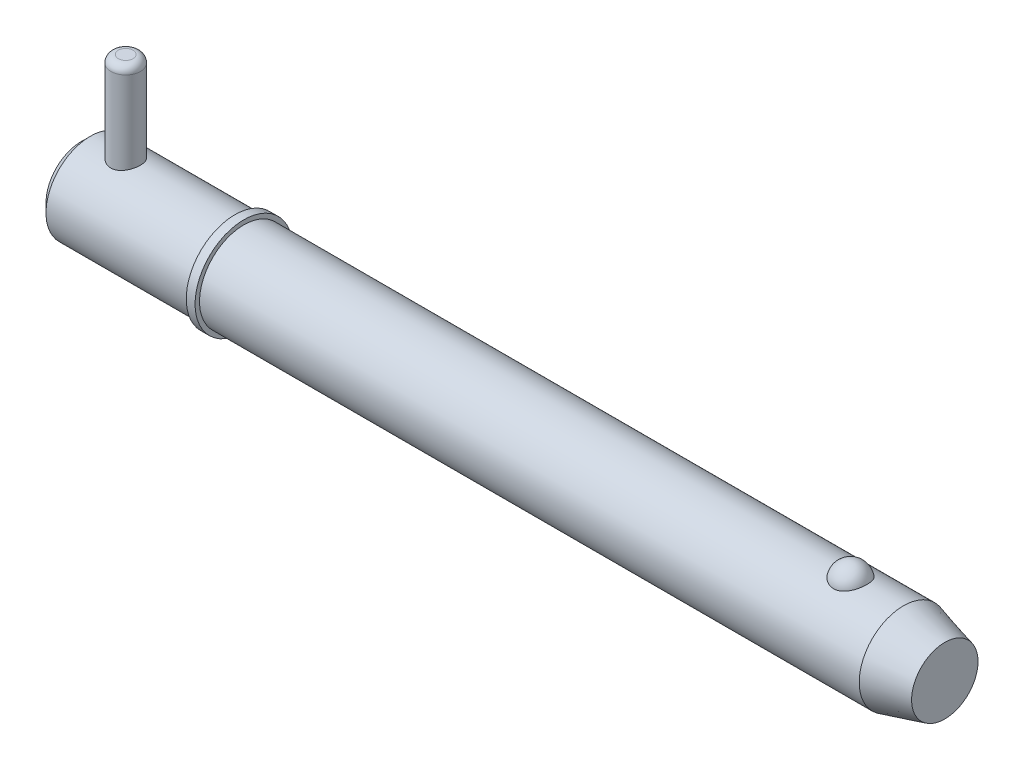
ISO-10303-21;
HEADER;
FILE_DESCRIPTION(('STEP AP214'),'2;1');
FILE_NAME('part.step','',(''),(''),'','','');
FILE_SCHEMA(('AUTOMOTIVE_DESIGN { 1 0 10303 214 1 1 1 1 }'));
ENDSEC;
DATA;
#1=APPLICATION_CONTEXT('core data for automotive mechanical design processes');
#2=APPLICATION_PROTOCOL_DEFINITION('international standard','automotive_design',2000,#1);
#3=PRODUCT_CONTEXT('',#1,'mechanical');
#4=PRODUCT('Part','Part','',(#3));
#5=PRODUCT_RELATED_PRODUCT_CATEGORY('part','',(#4));
#6=PRODUCT_DEFINITION_FORMATION('','',#4);
#7=PRODUCT_DEFINITION_CONTEXT('part definition',#1,'design');
#8=PRODUCT_DEFINITION('design','',#6,#7);
#9=PRODUCT_DEFINITION_SHAPE('','',#8);
#10=(LENGTH_UNIT() NAMED_UNIT(*) SI_UNIT(.MILLI.,.METRE.));
#11=(NAMED_UNIT(*) PLANE_ANGLE_UNIT() SI_UNIT($,.RADIAN.));
#12=(NAMED_UNIT(*) SI_UNIT($,.STERADIAN.) SOLID_ANGLE_UNIT());
#13=UNCERTAINTY_MEASURE_WITH_UNIT(LENGTH_MEASURE(1.E-05),#10,'distance_accuracy_value','');
#14=(GEOMETRIC_REPRESENTATION_CONTEXT(3) GLOBAL_UNCERTAINTY_ASSIGNED_CONTEXT((#13)) GLOBAL_UNIT_ASSIGNED_CONTEXT((#10,
#11,#12)) REPRESENTATION_CONTEXT('',''));
#15=CARTESIAN_POINT('',(0.,0.,0.));
#16=DIRECTION('',(0.,0.,1.));
#17=DIRECTION('',(1.,0.,0.));
#18=AXIS2_PLACEMENT_3D('',#15,#16,#17);
#19=CARTESIAN_POINT('',(9.52500000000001,28.575,0.));
#20=DIRECTION('',(0.,-1.,0.));
#21=DIRECTION('',(0.,0.,-1.));
#22=AXIS2_PLACEMENT_3D('',#19,#20,#21);
#23=CYLINDRICAL_SURFACE('',#22,3.175);
#24=CARTESIAN_POINT('',(9.52500000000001,-7.93750000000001,0.));
#25=DIRECTION('',(0.,1.,0.));
#26=DIRECTION('',(0.,0.,1.));
#27=AXIS2_PLACEMENT_3D('',#24,#25,#26);
#28=CIRCLE('',#27,3.175);
#29=CARTESIAN_POINT('',(9.52500000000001,-7.93750000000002,-3.175));
#30=VERTEX_POINT('',#29);
#31=EDGE_CURVE('P0_E25',#30,#30,#28,.T.);
#32=CARTESIAN_POINT('',(9.52500000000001,26.9875,0.));
#33=DIRECTION('',(0.,1.,0.));
#34=DIRECTION('',(0.,0.,1.));
#35=AXIS2_PLACEMENT_3D('',#32,#33,#34);
#36=CIRCLE('',#35,3.175);
#37=CARTESIAN_POINT('',(9.52500000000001,26.9875,-3.175));
#38=VERTEX_POINT('',#37);
#39=EDGE_CURVE('P0_E29',#38,#38,#36,.F.);
#40=CARTESIAN_POINT('',(9.52500000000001,-7.93750000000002,-3.175));
#41=CARTESIAN_POINT('',(9.52500000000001,-7.57369791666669,-3.175));
#42=CARTESIAN_POINT('',(9.52500000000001,-7.20989583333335,-3.175));
#43=CARTESIAN_POINT('',(9.52500000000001,-6.48229166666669,-3.175));
#44=CARTESIAN_POINT('',(9.52500000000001,-6.11848958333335,-3.175));
#45=CARTESIAN_POINT('',(9.52500000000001,-5.39088541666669,-3.175));
#46=CARTESIAN_POINT('',(9.52500000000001,-5.02708333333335,-3.175));
#47=CARTESIAN_POINT('',(9.52500000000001,-4.29947916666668,-3.175));
#48=CARTESIAN_POINT('',(9.52500000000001,-3.93567708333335,-3.175));
#49=CARTESIAN_POINT('',(9.52500000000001,-3.20807291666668,-3.175));
#50=CARTESIAN_POINT('',(9.52500000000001,-2.84427083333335,-3.175));
#51=CARTESIAN_POINT('',(9.52500000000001,-2.11666666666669,-3.175));
#52=CARTESIAN_POINT('',(9.52500000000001,-1.75286458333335,-3.175));
#53=CARTESIAN_POINT('',(9.52500000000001,-1.02526041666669,-3.175));
#54=CARTESIAN_POINT('',(9.52500000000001,-0.661458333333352,-3.175));
#55=CARTESIAN_POINT('',(9.52500000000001,0.0661458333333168,-3.175));
#56=CARTESIAN_POINT('',(9.52500000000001,0.429947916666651,-3.175));
#57=CARTESIAN_POINT('',(9.52500000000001,1.15755208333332,-3.175));
#58=CARTESIAN_POINT('',(9.52500000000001,1.52135416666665,-3.175));
#59=CARTESIAN_POINT('',(9.52500000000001,2.24895833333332,-3.175));
#60=CARTESIAN_POINT('',(9.52500000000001,2.61276041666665,-3.175));
#61=CARTESIAN_POINT('',(9.52500000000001,3.34036458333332,-3.175));
#62=CARTESIAN_POINT('',(9.52500000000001,3.70416666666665,-3.175));
#63=CARTESIAN_POINT('',(9.52500000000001,4.43177083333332,-3.175));
#64=CARTESIAN_POINT('',(9.52500000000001,4.79557291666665,-3.175));
#65=CARTESIAN_POINT('',(9.52500000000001,5.52317708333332,-3.175));
#66=CARTESIAN_POINT('',(9.52500000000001,5.88697916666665,-3.175));
#67=CARTESIAN_POINT('',(9.52500000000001,6.61458333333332,-3.175));
#68=CARTESIAN_POINT('',(9.52500000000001,6.97838541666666,-3.175));
#69=CARTESIAN_POINT('',(9.52500000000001,7.70598958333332,-3.175));
#70=CARTESIAN_POINT('',(9.52500000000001,8.06979166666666,-3.175));
#71=CARTESIAN_POINT('',(9.52500000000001,8.79739583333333,-3.175));
#72=CARTESIAN_POINT('',(9.52500000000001,9.16119791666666,-3.175));
#73=CARTESIAN_POINT('',(9.52500000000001,9.88880208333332,-3.175));
#74=CARTESIAN_POINT('',(9.52500000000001,10.2526041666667,-3.175));
#75=CARTESIAN_POINT('',(9.52500000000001,10.9802083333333,-3.175));
#76=CARTESIAN_POINT('',(9.52500000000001,11.3440104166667,-3.175));
#77=CARTESIAN_POINT('',(9.52500000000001,12.0716145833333,-3.175));
#78=CARTESIAN_POINT('',(9.52500000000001,12.4354166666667,-3.175));
#79=CARTESIAN_POINT('',(9.52500000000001,13.1630208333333,-3.175));
#80=CARTESIAN_POINT('',(9.52500000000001,13.5268229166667,-3.175));
#81=CARTESIAN_POINT('',(9.52500000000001,14.2544270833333,-3.175));
#82=CARTESIAN_POINT('',(9.52500000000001,14.6182291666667,-3.175));
#83=CARTESIAN_POINT('',(9.52500000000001,15.3458333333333,-3.175));
#84=CARTESIAN_POINT('',(9.52500000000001,15.7096354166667,-3.175));
#85=CARTESIAN_POINT('',(9.52500000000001,16.4372395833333,-3.175));
#86=CARTESIAN_POINT('',(9.52500000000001,16.8010416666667,-3.175));
#87=CARTESIAN_POINT('',(9.52500000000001,17.5286458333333,-3.175));
#88=CARTESIAN_POINT('',(9.52500000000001,17.8924479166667,-3.175));
#89=CARTESIAN_POINT('',(9.52500000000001,18.6200520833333,-3.175));
#90=CARTESIAN_POINT('',(9.52500000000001,18.9838541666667,-3.175));
#91=CARTESIAN_POINT('',(9.52500000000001,19.7114583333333,-3.175));
#92=CARTESIAN_POINT('',(9.52500000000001,20.0752604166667,-3.175));
#93=CARTESIAN_POINT('',(9.52500000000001,20.8028645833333,-3.175));
#94=CARTESIAN_POINT('',(9.52500000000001,21.1666666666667,-3.175));
#95=CARTESIAN_POINT('',(9.52500000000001,21.8942708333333,-3.175));
#96=CARTESIAN_POINT('',(9.52500000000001,22.2580729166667,-3.175));
#97=CARTESIAN_POINT('',(9.52500000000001,22.9856770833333,-3.175));
#98=CARTESIAN_POINT('',(9.52500000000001,23.3494791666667,-3.175));
#99=CARTESIAN_POINT('',(9.52500000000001,24.0770833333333,-3.175));
#100=CARTESIAN_POINT('',(9.52500000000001,24.4408854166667,-3.175));
#101=CARTESIAN_POINT('',(9.52500000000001,25.1684895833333,-3.175));
#102=CARTESIAN_POINT('',(9.52500000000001,25.5322916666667,-3.175));
#103=CARTESIAN_POINT('',(9.52500000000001,26.2598958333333,-3.175));
#104=CARTESIAN_POINT('',(9.52500000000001,26.6236979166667,-3.175));
#105=CARTESIAN_POINT('',(9.52500000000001,26.9875,-3.175));
#106=B_SPLINE_CURVE_WITH_KNOTS('',3,(#40,#41,#42,#43,#44,#45,#46,#47,#48,#49,#50,#51,#52,#53,
#54,#55,#56,#57,#58,#59,#60,#61,#62,#63,#64,#65,#66,#67,#68,#69,#70,#71,#72,#73,#74,#75,#76,#77,
#78,#79,#80,#81,#82,#83,#84,#85,#86,#87,#88,#89,#90,#91,#92,#93,#94,#95,#96,#97,#98,#99,#100,
#101,#102,#103,#104,#105),.UNSPECIFIED.,.F.,.F.,(4,2,2,2,2,2,2,2,2,2,2,2,2,2,2,2,2,2,2,2,2,2,2,
2,2,2,2,2,2,2,2,2,4),(0.,1.09140625,2.1828125,3.27421875,4.365625,5.45703125,6.5484375,
7.63984375,8.73125000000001,9.82265625,10.9140625,12.00546875,13.096875,14.18828125,15.2796875,
16.37109375,17.4625,18.55390625,19.6453125,20.73671875,21.828125,22.91953125,24.0109375,
25.10234375,26.19375,27.28515625,28.3765625,29.46796875,30.559375,31.65078125,32.7421875,
33.83359375,34.925),.UNSPECIFIED.);
#107=EDGE_CURVE('P0_BSEAM14',#30,#38,#106,.T.);
#108=ORIENTED_EDGE('',*,*,#31,.T.);
#109=ORIENTED_EDGE('',*,*,#39,.T.);
#110=ORIENTED_EDGE('',*,*,#107,.T.);
#111=ORIENTED_EDGE('',*,*,#107,.F.);
#112=EDGE_LOOP('',(#108,#110,#109,#111));
#113=FACE_BOUND('',#112,.T.);
#114=ADVANCED_FACE('P0_F14',(#113),#23,.T.);
#115=CARTESIAN_POINT('',(9.52500000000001,28.575,0.));
#116=DIRECTION('',(0.,1.,0.));
#117=DIRECTION('',(0.,0.,1.));
#118=AXIS2_PLACEMENT_3D('',#115,#116,#117);
#119=PLANE('',#118);
#120=CARTESIAN_POINT('',(9.52500000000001,28.575,0.));
#121=DIRECTION('',(0.,1.,0.));
#122=DIRECTION('',(0.,0.,1.));
#123=AXIS2_PLACEMENT_3D('',#120,#121,#122);
#124=CIRCLE('',#123,1.5875);
#125=CARTESIAN_POINT('',(9.52500000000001,28.575,1.5875));
#126=VERTEX_POINT('',#125);
#127=EDGE_CURVE('P0_E10',#126,#126,#124,.T.);
#128=ORIENTED_EDGE('',*,*,#127,.T.);
#129=EDGE_LOOP('',(#128));
#130=FACE_BOUND('',#129,.T.);
#131=ADVANCED_FACE('P0_F46',(#130),#119,.T.);
#132=CARTESIAN_POINT('',(9.52500000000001,-9.525,0.));
#133=DIRECTION('',(0.,1.,0.));
#134=DIRECTION('',(0.,0.,1.));
#135=AXIS2_PLACEMENT_3D('',#132,#133,#134);
#136=PLANE('',#135);
#137=CARTESIAN_POINT('',(9.52500000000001,-9.525,0.));
#138=DIRECTION('',(0.,1.,0.));
#139=DIRECTION('',(0.,0.,1.));
#140=AXIS2_PLACEMENT_3D('',#137,#138,#139);
#141=CIRCLE('',#140,1.5875);
#142=CARTESIAN_POINT('',(9.52500000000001,-9.525,1.5875));
#143=VERTEX_POINT('',#142);
#144=EDGE_CURVE('P0_E21',#143,#143,#141,.F.);
#145=ORIENTED_EDGE('',*,*,#144,.T.);
#146=EDGE_LOOP('',(#145));
#147=FACE_BOUND('',#146,.T.);
#148=ADVANCED_FACE('P0_F43',(#147),#136,.F.);
#149=CARTESIAN_POINT('',(9.52500000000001,-7.9375,0.));
#150=DIRECTION('',(0.,1.,0.));
#151=DIRECTION('',(0.,0.,1.));
#152=AXIS2_PLACEMENT_3D('',#149,#150,#151);
#153=DEGENERATE_TOROIDAL_SURFACE('',#152,1.5875,1.5875,.T.);
#154=ORIENTED_EDGE('',*,*,#144,.F.);
#155=EDGE_LOOP('',(#154));
#156=FACE_BOUND('',#155,.T.);
#157=ORIENTED_EDGE('',*,*,#31,.F.);
#158=EDGE_LOOP('',(#157));
#159=FACE_BOUND('',#158,.T.);
#160=ADVANCED_FACE('P0_F38',(#156,#159),#153,.T.);
#161=CARTESIAN_POINT('',(9.52500000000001,26.9875,0.));
#162=DIRECTION('',(0.,1.,0.));
#163=DIRECTION('',(0.,0.,1.));
#164=AXIS2_PLACEMENT_3D('',#161,#162,#163);
#165=DEGENERATE_TOROIDAL_SURFACE('',#164,1.5875,1.5875,.T.);
#166=ORIENTED_EDGE('',*,*,#39,.F.);
#167=EDGE_LOOP('',(#166));
#168=FACE_BOUND('',#167,.T.);
#169=ORIENTED_EDGE('',*,*,#127,.F.);
#170=EDGE_LOOP('',(#169));
#171=FACE_BOUND('',#170,.T.);
#172=ADVANCED_FACE('P0_F16',(#168,#171),#165,.T.);
#173=CLOSED_SHELL('',(#114,#131,#148,#160,#172));
#174=MANIFOLD_SOLID_BREP('P0_B1',#173);
#175=CARTESIAN_POINT('',(0.,0.,0.));
#176=DIRECTION('',(1.,0.,0.));
#177=DIRECTION('',(0.,0.,-1.));
#178=AXIS2_PLACEMENT_3D('',#175,#176,#177);
#179=CYLINDRICAL_SURFACE('',#178,9.525);
#180=CARTESIAN_POINT('',(176.843054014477,0.,0.));
#181=DIRECTION('',(1.,0.,0.));
#182=DIRECTION('',(0.,0.,-1.));
#183=AXIS2_PLACEMENT_3D('',#180,#181,#182);
#184=CIRCLE('',#183,9.525);
#185=CARTESIAN_POINT('',(176.843054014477,0.,-9.525));
#186=VERTEX_POINT('',#185);
#187=EDGE_CURVE('P1_E81',#186,#186,#184,.T.);
#188=ORIENTED_EDGE('',*,*,#187,.F.);
#189=EDGE_LOOP('',(#188));
#190=FACE_BOUND('',#189,.T.);
#191=CARTESIAN_POINT('',(34.93,0.,0.));
#192=DIRECTION('',(1.,0.,0.));
#193=DIRECTION('',(0.,0.,-1.));
#194=AXIS2_PLACEMENT_3D('',#191,#192,#193);
#195=CIRCLE('',#194,9.525);
#196=CARTESIAN_POINT('',(34.93,0.,-9.525));
#197=VERTEX_POINT('',#196);
#198=EDGE_CURVE('P1_E85',#197,#197,#195,.T.);
#199=ORIENTED_EDGE('',*,*,#198,.T.);
#200=EDGE_LOOP('',(#199));
#201=FACE_BOUND('',#200,.T.);
#202=CARTESIAN_POINT('',(165.445757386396,8.80405803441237,3.63513233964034));
#203=CARTESIAN_POINT('',(165.351676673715,8.80405953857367,3.63513053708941));
#204=CARTESIAN_POINT('',(165.257561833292,8.80561325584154,3.63137461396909));
#205=CARTESIAN_POINT('',(165.070012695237,8.81177748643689,3.61638665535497));
#206=CARTESIAN_POINT('',(164.976578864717,8.81638992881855,3.60514990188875));
#207=CARTESIAN_POINT('',(164.697945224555,8.8346711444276,3.56024627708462));
#208=CARTESIAN_POINT('',(164.514691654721,8.85278327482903,3.51538626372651));
#209=CARTESIAN_POINT('',(164.159509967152,8.89871214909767,3.39742145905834));
#210=CARTESIAN_POINT('',(163.987553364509,8.92650327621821,3.32439116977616));
#211=CARTESIAN_POINT('',(163.658707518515,8.9887481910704,3.15220244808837));
#212=CARTESIAN_POINT('',(163.501811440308,9.02319893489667,3.05305594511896));
#213=CARTESIAN_POINT('',(163.202214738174,9.09629186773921,2.82797815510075));
#214=CARTESIAN_POINT('',(163.060060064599,9.13502685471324,2.70135138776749));
#215=CARTESIAN_POINT('',(162.798299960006,9.2118657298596,2.42641932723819));
#216=CARTESIAN_POINT('',(162.678701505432,9.24996941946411,2.27810735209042));
#217=CARTESIAN_POINT('',(162.459645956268,9.32341082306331,1.95652290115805));
#218=CARTESIAN_POINT('',(162.361317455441,9.35855090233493,1.78243511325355));
#219=CARTESIAN_POINT('',(162.193819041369,9.42045142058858,1.419372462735));
#220=CARTESIAN_POINT('',(162.124651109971,9.44721128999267,1.23039658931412));
#221=CARTESIAN_POINT('',(162.016199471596,9.48990641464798,0.840370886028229));
#222=CARTESIAN_POINT('',(161.977288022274,9.50570658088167,0.639202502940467));
#223=CARTESIAN_POINT('',(161.931555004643,9.52433146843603,0.232664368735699));
#224=CARTESIAN_POINT('',(161.924732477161,9.52715657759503,0.0272947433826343));
#225=CARTESIAN_POINT('',(161.943255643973,9.51956918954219,-0.380478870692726));
#226=CARTESIAN_POINT('',(161.968405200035,9.50923740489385,-0.582893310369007));
#227=CARTESIAN_POINT('',(162.05002537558,9.47651897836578,-0.980293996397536));
#228=CARTESIAN_POINT('',(162.106496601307,9.45413210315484,-1.17528009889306));
#229=CARTESIAN_POINT('',(162.249719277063,9.39954044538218,-1.55263697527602));
#230=CARTESIAN_POINT('',(162.336512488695,9.36732213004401,-1.73498993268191));
#231=CARTESIAN_POINT('',(162.538610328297,9.29640700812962,-2.08177763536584));
#232=CARTESIAN_POINT('',(162.653917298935,9.25770966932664,-2.24621090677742));
#233=CARTESIAN_POINT('',(162.911264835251,9.17775604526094,-2.5533833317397));
#234=CARTESIAN_POINT('',(163.053434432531,9.136488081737,-2.696011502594));
#235=CARTESIAN_POINT('',(163.36089985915,9.05620497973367,-2.95451229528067));
#236=CARTESIAN_POINT('',(163.526193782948,9.01718965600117,-3.07038711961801));
#237=CARTESIAN_POINT('',(163.872052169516,8.94680019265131,-3.26976836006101));
#238=CARTESIAN_POINT('',(164.052227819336,8.91528408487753,-3.35389750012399));
#239=CARTESIAN_POINT('',(164.425651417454,8.86272514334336,-3.49043503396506));
#240=CARTESIAN_POINT('',(164.618894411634,8.84167836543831,-3.54285537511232));
#241=CARTESIAN_POINT('',(165.002503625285,8.81348056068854,-3.61241306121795));
#242=CARTESIAN_POINT('',(165.192525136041,8.80568348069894,-3.6311933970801));
#243=CARTESIAN_POINT('',(165.573190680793,8.80289410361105,-3.63795342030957));
#244=CARTESIAN_POINT('',(165.763834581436,8.80789922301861,-3.62593932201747));
#245=CARTESIAN_POINT('',(166.134007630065,8.82974915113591,-3.57238430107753));
#246=CARTESIAN_POINT('',(166.313697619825,8.84621463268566,-3.53178890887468));
#247=CARTESIAN_POINT('',(166.663422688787,8.88875330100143,-3.42331083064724));
#248=CARTESIAN_POINT('',(166.833456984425,8.91482726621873,-3.35542593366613));
#249=CARTESIAN_POINT('',(167.163237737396,8.97448239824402,-3.19248225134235));
#250=CARTESIAN_POINT('',(167.322680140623,9.00821446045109,-3.0968647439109));
#251=CARTESIAN_POINT('',(167.623513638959,9.07935398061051,-2.88162736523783));
#252=CARTESIAN_POINT('',(167.764900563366,9.11676228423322,-2.76200196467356));
#253=CARTESIAN_POINT('',(168.03331931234,9.19347419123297,-2.49516285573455));
#254=CARTESIAN_POINT('',(168.159275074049,9.23277872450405,-2.34686614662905));
#255=CARTESIAN_POINT('',(168.385522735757,9.30737610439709,-2.03093683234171));
#256=CARTESIAN_POINT('',(168.48581004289,9.34266823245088,-1.86330077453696));
#257=CARTESIAN_POINT('',(168.661514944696,9.40674710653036,-1.50744893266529));
#258=CARTESIAN_POINT('',(168.736041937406,9.4352917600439,-1.31874876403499));
#259=CARTESIAN_POINT('',(168.85416505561,9.48144132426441,-0.930631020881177));
#260=CARTESIAN_POINT('',(168.897760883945,9.49904612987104,-0.731213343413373));
#261=CARTESIAN_POINT('',(168.953158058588,9.5215314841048,-0.327147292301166));
#262=CARTESIAN_POINT('',(168.964935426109,9.52640243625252,-0.122495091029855));
#263=CARTESIAN_POINT('',(168.956382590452,9.52289571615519,0.286018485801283));
#264=CARTESIAN_POINT('',(168.93605305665,9.51451832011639,0.489879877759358));
#265=CARTESIAN_POINT('',(168.863884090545,9.48544083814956,0.889994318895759));
#266=CARTESIAN_POINT('',(168.812199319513,9.46480124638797,1.08627971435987));
#267=CARTESIAN_POINT('',(168.678491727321,9.41333895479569,1.46682086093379));
#268=CARTESIAN_POINT('',(168.596466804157,9.38251554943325,1.65107577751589));
#269=CARTESIAN_POINT('',(168.40319292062,9.31365636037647,2.00346348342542));
#270=CARTESIAN_POINT('',(168.291783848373,9.27558138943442,2.17150083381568));
#271=CARTESIAN_POINT('',(168.042294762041,9.19638714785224,2.48563115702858));
#272=CARTESIAN_POINT('',(167.904216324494,9.15526805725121,2.63172542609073));
#273=CARTESIAN_POINT('',(167.604843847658,9.07465393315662,2.89750997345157));
#274=CARTESIAN_POINT('',(167.443610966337,9.03515496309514,3.01726776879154));
#275=CARTESIAN_POINT('',(167.101613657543,8.96227564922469,3.22732920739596));
#276=CARTESIAN_POINT('',(166.920841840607,8.92889763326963,3.31762165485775));
#277=CARTESIAN_POINT('',(166.551445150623,8.8734538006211,3.46314419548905));
#278=CARTESIAN_POINT('',(166.36332371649,8.85102983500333,3.51950082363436));
#279=CARTESIAN_POINT('',(166.07578699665,8.8266696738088,3.57993683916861));
#280=CARTESIAN_POINT('',(165.979133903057,8.82009725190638,3.5960621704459));
#281=CARTESIAN_POINT('',(165.784677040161,8.81020897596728,3.62022512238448));
#282=CARTESIAN_POINT('',(165.68687410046,8.80689090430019,3.62826825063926));
#283=CARTESIAN_POINT('',(165.541224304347,8.80445615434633,3.63416760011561));
#284=CARTESIAN_POINT('',(165.493495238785,8.80405727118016,3.63513325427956));
#285=CARTESIAN_POINT('',(165.445757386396,8.80405803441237,3.63513233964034));
#286=B_SPLINE_CURVE_WITH_KNOTS('',3,(#202,#203,#204,#205,#206,#207,#208,#209,#210,#211,#212,
#213,#214,#215,#216,#217,#218,#219,#220,#221,#222,#223,#224,#225,#226,#227,#228,#229,#230,#231,
#232,#233,#234,#235,#236,#237,#238,#239,#240,#241,#242,#243,#244,#245,#246,#247,#248,#249,#250,
#251,#252,#253,#254,#255,#256,#257,#258,#259,#260,#261,#262,#263,#264,#265,#266,#267,#268,#269,
#270,#271,#272,#273,#274,#275,#276,#277,#278,#279,#280,#281,#282,#283,#284,#285),.UNSPECIFIED.,
.T.,.F.,(4,2,2,2,2,2,2,2,2,2,2,2,2,2,2,2,2,2,2,2,2,2,2,2,2,2,2,2,2,2,2,2,2,2,2,2,2,2,2,2,2,4),
(0.,0.282202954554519,0.564584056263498,1.13017050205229,1.69427128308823,2.25811483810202,
2.83836627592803,3.41879688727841,4.02497117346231,4.63118665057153,5.2447475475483,
5.85829010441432,6.46808687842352,7.07789545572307,7.68854723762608,8.29924920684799,
8.9129628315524,9.52662591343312,10.1275338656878,10.7282152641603,11.2986646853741,
11.8689989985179,12.4213015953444,12.973648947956,13.5380053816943,14.1024919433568,
14.695298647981,15.2882113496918,15.8999469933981,16.5116885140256,17.1238909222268,
17.7360805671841,18.3452748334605,18.9545113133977,19.567138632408,20.179729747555,
20.7907316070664,21.4019653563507,21.9915938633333,22.2859053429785,22.5800161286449,
22.7232098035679),.UNSPECIFIED.);
#287=CARTESIAN_POINT('',(165.445757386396,8.80405803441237,3.63513233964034));
#288=VERTEX_POINT('',#287);
#289=EDGE_CURVE('P1_E35',#288,#288,#286,.T.);
#290=ORIENTED_EDGE('',*,*,#289,.T.);
#291=EDGE_LOOP('',(#290));
#292=FACE_BOUND('',#291,.T.);
#293=ADVANCED_FACE('P1_F13',(#190,#201,#292),#179,.T.);
#294=CARTESIAN_POINT('',(0.,0.,0.));
#295=DIRECTION('',(-1.,0.,0.));
#296=DIRECTION('',(0.,0.,1.));
#297=AXIS2_PLACEMENT_3D('',#294,#295,#296);
#298=PLANE('',#297);
#299=CARTESIAN_POINT('',(0.,0.,0.));
#300=DIRECTION('',(1.,0.,0.));
#301=DIRECTION('',(0.,0.,-1.));
#302=AXIS2_PLACEMENT_3D('',#299,#300,#301);
#303=CIRCLE('',#302,7.62);
#304=CARTESIAN_POINT('',(0.,0.,-7.62));
#305=VERTEX_POINT('',#304);
#306=EDGE_CURVE('P1_E9',#305,#305,#303,.T.);
#307=ORIENTED_EDGE('',*,*,#306,.F.);
#308=EDGE_LOOP('',(#307));
#309=FACE_BOUND('',#308,.T.);
#310=ADVANCED_FACE('P1_F15',(#309),#298,.T.);
#311=CARTESIAN_POINT('',(1.90499999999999,0.,0.));
#312=DIRECTION('',(1.,0.,0.));
#313=DIRECTION('',(0.,0.,-1.));
#314=AXIS2_PLACEMENT_3D('',#311,#312,#313);
#315=CONICAL_SURFACE('',#314,9.525,0.785398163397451);
#316=ORIENTED_EDGE('',*,*,#306,.T.);
#317=EDGE_LOOP('',(#316));
#318=FACE_BOUND('',#317,.T.);
#319=CARTESIAN_POINT('',(1.90499999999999,0.,0.));
#320=DIRECTION('',(1.,0.,0.));
#321=DIRECTION('',(0.,0.,-1.));
#322=AXIS2_PLACEMENT_3D('',#319,#320,#321);
#323=CIRCLE('',#322,9.525);
#324=CARTESIAN_POINT('',(1.90499999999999,0.,-9.525));
#325=VERTEX_POINT('',#324);
#326=EDGE_CURVE('P1_E26',#325,#325,#323,.T.);
#327=ORIENTED_EDGE('',*,*,#326,.F.);
#328=EDGE_LOOP('',(#327));
#329=FACE_BOUND('',#328,.T.);
#330=ADVANCED_FACE('P1_F77',(#318,#329),#315,.T.);
#331=CARTESIAN_POINT('',(0.,0.,0.));
#332=DIRECTION('',(1.,0.,0.));
#333=DIRECTION('',(0.,0.,-1.));
#334=AXIS2_PLACEMENT_3D('',#331,#332,#333);
#335=CYLINDRICAL_SURFACE('',#334,9.525);
#336=CARTESIAN_POINT('',(9.525,-8.98025612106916,3.175));
#337=CARTESIAN_POINT('',(9.35206354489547,-8.98025555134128,3.17500081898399));
#338=CARTESIAN_POINT('',(9.17913201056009,-8.98530617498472,3.16082293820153));
#339=CARTESIAN_POINT('',(8.83839221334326,-9.00485797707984,3.10467734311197));
#340=CARTESIAN_POINT('',(8.67058479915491,-9.0193607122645,3.06270505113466));
#341=CARTESIAN_POINT('',(8.34508461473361,-9.05599546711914,2.95260866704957));
#342=CARTESIAN_POINT('',(8.18737272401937,-9.07811252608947,2.88453582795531));
#343=CARTESIAN_POINT('',(7.88555684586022,-9.12746212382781,2.72434567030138));
#344=CARTESIAN_POINT('',(7.74145587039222,-9.1546957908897,2.63222304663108));
#345=CARTESIAN_POINT('',(7.46531411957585,-9.21240503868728,2.42268738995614));
#346=CARTESIAN_POINT('',(7.33388351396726,-9.24296141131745,2.30449228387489));
#347=CARTESIAN_POINT('',(7.09229340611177,-9.30319020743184,2.0478358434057));
#348=CARTESIAN_POINT('',(6.98213731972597,-9.33286248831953,1.90937126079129));
#349=CARTESIAN_POINT('',(6.78345450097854,-9.38891527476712,1.61164431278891));
#350=CARTESIAN_POINT('',(6.69556709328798,-9.41518969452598,1.45193356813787));
#351=CARTESIAN_POINT('',(6.54814671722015,-9.46053437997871,1.11896913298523));
#352=CARTESIAN_POINT('',(6.48860610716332,-9.47960658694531,0.945719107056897));
#353=CARTESIAN_POINT('',(6.40163866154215,-9.50782564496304,0.596991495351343));
#354=CARTESIAN_POINT('',(6.373166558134,-9.5172947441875,0.421801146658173));
#355=CARTESIAN_POINT('',(6.3458207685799,-9.52638456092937,0.068890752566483));
#356=CARTESIAN_POINT('',(6.34693945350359,-9.52600781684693,-0.108828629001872));
#357=CARTESIAN_POINT('',(6.37808050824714,-9.51566675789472,-0.454353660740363));
#358=CARTESIAN_POINT('',(6.4069675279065,-9.50607905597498,-0.622274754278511));
#359=CARTESIAN_POINT('',(6.490947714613,-9.47886621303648,-0.950732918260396));
#360=CARTESIAN_POINT('',(6.54604265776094,-9.46124052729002,-1.11126948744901));
#361=CARTESIAN_POINT('',(6.68153768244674,-9.41945253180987,-1.42288410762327));
#362=CARTESIAN_POINT('',(6.76226085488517,-9.3952073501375,-1.57381010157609));
#363=CARTESIAN_POINT('',(6.94645456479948,-9.34270397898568,-1.86030973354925));
#364=CARTESIAN_POINT('',(7.04993142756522,-9.31444467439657,-1.99587908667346));
#365=CARTESIAN_POINT('',(7.28241619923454,-9.25532159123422,-2.2545702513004));
#366=CARTESIAN_POINT('',(7.4123967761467,-9.22439783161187,-2.37680549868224));
#367=CARTESIAN_POINT('',(7.69127470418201,-9.1645528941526,-2.5980302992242));
#368=CARTESIAN_POINT('',(7.84017496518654,-9.13563202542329,-2.6970162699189));
#369=CARTESIAN_POINT('',(8.15547526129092,-9.08273917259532,-2.87016016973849));
#370=CARTESIAN_POINT('',(8.32209451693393,-9.05884361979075,-2.94394402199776));
#371=CARTESIAN_POINT('',(8.66638917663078,-9.01959241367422,-3.06210713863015));
#372=CARTESIAN_POINT('',(8.84405991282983,-9.00423318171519,-3.10649872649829));
#373=CARTESIAN_POINT('',(9.19682677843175,-8.98460345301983,-3.16281207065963));
#374=CARTESIAN_POINT('',(9.37167742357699,-8.9798639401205,-3.17610837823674));
#375=CARTESIAN_POINT('',(9.72113927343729,-8.9806993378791,-3.17374726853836));
#376=CARTESIAN_POINT('',(9.89575051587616,-8.98627237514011,-3.15809511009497));
#377=CARTESIAN_POINT('',(10.2335233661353,-9.00663737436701,-3.09951644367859));
#378=CARTESIAN_POINT('',(10.3968722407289,-9.02110608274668,-3.05754530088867));
#379=CARTESIAN_POINT('',(10.7141759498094,-9.05727657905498,-2.94866651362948));
#380=CARTESIAN_POINT('',(10.8681291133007,-9.07897964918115,-2.88175444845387));
#381=CARTESIAN_POINT('',(11.1676828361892,-9.12802586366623,-2.72248103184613));
#382=CARTESIAN_POINT('',(11.3128635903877,-9.1555260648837,-2.62937980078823));
#383=CARTESIAN_POINT('',(11.5860387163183,-9.21276315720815,-2.42120937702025));
#384=CARTESIAN_POINT('',(11.7140280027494,-9.24250070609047,-2.30613370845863));
#385=CARTESIAN_POINT('',(11.9555513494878,-9.30259247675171,-2.05070616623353));
#386=CARTESIAN_POINT('',(12.0680936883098,-9.33290753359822,-1.90940458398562));
#387=CARTESIAN_POINT('',(12.267933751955,-9.3893275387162,-1.60917665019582));
#388=CARTESIAN_POINT('',(12.3552323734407,-9.41543263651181,-1.45025092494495));
#389=CARTESIAN_POINT('',(12.5013088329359,-9.46036988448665,-1.12007606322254));
#390=CARTESIAN_POINT('',(12.5602723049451,-9.47924920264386,-0.9489158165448));
#391=CARTESIAN_POINT('',(12.6483355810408,-9.50781089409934,-0.598355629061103));
#392=CARTESIAN_POINT('',(12.6774461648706,-9.5174965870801,-0.4189586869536));
#393=CARTESIAN_POINT('',(12.7040070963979,-9.52632915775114,-0.066088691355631));
#394=CARTESIAN_POINT('',(12.7028811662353,-9.52594996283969,0.107266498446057));
#395=CARTESIAN_POINT('',(12.6725130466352,-9.51586223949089,0.451202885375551));
#396=CARTESIAN_POINT('',(12.643273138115,-9.50615446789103,0.621784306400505));
#397=CARTESIAN_POINT('',(12.5584514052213,-9.47867404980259,0.952633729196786));
#398=CARTESIAN_POINT('',(12.5032953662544,-9.46103195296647,1.1130225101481));
#399=CARTESIAN_POINT('',(12.3686013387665,-9.41949985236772,1.42233126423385));
#400=CARTESIAN_POINT('',(12.2890589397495,-9.39560871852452,1.57124915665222));
#401=CARTESIAN_POINT('',(12.1044667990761,-9.34294133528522,1.85938800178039));
#402=CARTESIAN_POINT('',(11.9985831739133,-9.31401720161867,1.9980473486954));
#403=CARTESIAN_POINT('',(11.7657327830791,-9.25490239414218,2.25609475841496));
#404=CARTESIAN_POINT('',(11.6387592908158,-9.22471131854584,2.37547664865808));
#405=CARTESIAN_POINT('',(11.3613902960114,-9.16505913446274,2.59633024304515));
#406=CARTESIAN_POINT('',(11.2102725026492,-9.13567286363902,2.69691791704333));
#407=CARTESIAN_POINT('',(10.8923631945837,-9.08241113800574,2.87119803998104));
#408=CARTESIAN_POINT('',(10.7255757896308,-9.05853424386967,2.94489751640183));
#409=CARTESIAN_POINT('',(10.3887212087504,-9.02021736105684,3.06020415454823));
#410=CARTESIAN_POINT('',(10.219143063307,-9.00539959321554,3.10311136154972));
#411=CARTESIAN_POINT('',(9.87470703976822,-8.98542092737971,3.16050396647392));
#412=CARTESIAN_POINT('',(9.699851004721,-8.98025669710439,3.17499917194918));
#413=CARTESIAN_POINT('',(9.525,-8.98025612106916,3.175));
#414=B_SPLINE_CURVE_WITH_KNOTS('',3,(#336,#337,#338,#339,#340,#341,#342,#343,#344,#345,#346,
#347,#348,#349,#350,#351,#352,#353,#354,#355,#356,#357,#358,#359,#360,#361,#362,#363,#364,#365,
#366,#367,#368,#369,#370,#371,#372,#373,#374,#375,#376,#377,#378,#379,#380,#381,#382,#383,#384,
#385,#386,#387,#388,#389,#390,#391,#392,#393,#394,#395,#396,#397,#398,#399,#400,#401,#402,#403,
#404,#405,#406,#407,#408,#409,#410,#411,#412,#413),.UNSPECIFIED.,.T.,.F.,(4,2,2,2,2,2,2,2,2,2,2,
2,2,2,2,2,2,2,2,2,2,2,2,2,2,2,2,2,2,2,2,2,2,2,2,2,2,2,4),(0.,0.518161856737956,1.03640907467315,
1.55364379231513,2.07099270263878,2.60671746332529,3.14252816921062,3.69231882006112,
4.24196117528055,4.77247962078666,5.30286129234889,5.81244090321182,6.32205505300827,
6.83836754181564,7.3548237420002,7.89559553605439,8.43645060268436,8.98501631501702,
9.53335188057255,10.056948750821,10.5804505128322,11.0859695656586,11.5915782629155,
12.1132237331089,12.6350231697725,13.1819271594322,13.7288117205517,14.2720628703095,
14.815117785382,15.3326491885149,15.8501386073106,16.3594083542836,16.868770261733,
17.3969527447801,17.925304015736,18.4743376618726,19.023227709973,19.5473069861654,
20.0712053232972),.UNSPECIFIED.);
#415=CARTESIAN_POINT('',(9.525,-8.98025612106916,3.175));
#416=VERTEX_POINT('',#415);
#417=EDGE_CURVE('P1_E17',#416,#416,#414,.T.);
#418=ORIENTED_EDGE('',*,*,#417,.F.);
#419=EDGE_LOOP('',(#418));
#420=FACE_BOUND('',#419,.T.);
#421=CARTESIAN_POINT('',(9.525,8.98025612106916,3.175));
#422=CARTESIAN_POINT('',(9.69793645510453,8.98025555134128,3.17500081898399));
#423=CARTESIAN_POINT('',(9.87086798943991,8.98530617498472,3.16082293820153));
#424=CARTESIAN_POINT('',(10.2116077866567,9.00485797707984,3.10467734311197));
#425=CARTESIAN_POINT('',(10.3794152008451,9.0193607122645,3.06270505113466));
#426=CARTESIAN_POINT('',(10.7049153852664,9.05599546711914,2.95260866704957));
#427=CARTESIAN_POINT('',(10.8626272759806,9.07811252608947,2.88453582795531));
#428=CARTESIAN_POINT('',(11.1644431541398,9.12746212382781,2.72434567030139));
#429=CARTESIAN_POINT('',(11.3085441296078,9.15469579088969,2.63222304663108));
#430=CARTESIAN_POINT('',(11.5846858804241,9.21240503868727,2.42268738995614));
#431=CARTESIAN_POINT('',(11.7161164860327,9.24296141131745,2.30449228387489));
#432=CARTESIAN_POINT('',(11.9577065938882,9.30319020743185,2.0478358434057));
#433=CARTESIAN_POINT('',(12.067862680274,9.33286248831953,1.90937126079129));
#434=CARTESIAN_POINT('',(12.2665454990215,9.38891527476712,1.61164431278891));
#435=CARTESIAN_POINT('',(12.354432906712,9.41518969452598,1.45193356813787));
#436=CARTESIAN_POINT('',(12.5018532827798,9.46053437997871,1.11896913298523));
#437=CARTESIAN_POINT('',(12.5613938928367,9.47960658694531,0.945719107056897));
#438=CARTESIAN_POINT('',(12.6483613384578,9.50782564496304,0.596991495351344));
#439=CARTESIAN_POINT('',(12.676833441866,9.5172947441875,0.421801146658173));
#440=CARTESIAN_POINT('',(12.7041792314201,9.52638456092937,0.0688907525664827));
#441=CARTESIAN_POINT('',(12.7030605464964,9.52600781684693,-0.108828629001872));
#442=CARTESIAN_POINT('',(12.6719194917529,9.51566675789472,-0.454353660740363));
#443=CARTESIAN_POINT('',(12.6430324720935,9.50607905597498,-0.622274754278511));
#444=CARTESIAN_POINT('',(12.559052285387,9.47886621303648,-0.950732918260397));
#445=CARTESIAN_POINT('',(12.5039573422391,9.46124052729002,-1.11126948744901));
#446=CARTESIAN_POINT('',(12.3684623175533,9.41945253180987,-1.42288410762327));
#447=CARTESIAN_POINT('',(12.2877391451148,9.3952073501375,-1.57381010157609));
#448=CARTESIAN_POINT('',(12.1035454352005,9.34270397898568,-1.86030973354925));
#449=CARTESIAN_POINT('',(12.0000685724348,9.31444467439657,-1.99587908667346));
#450=CARTESIAN_POINT('',(11.7675838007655,9.25532159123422,-2.2545702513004));
#451=CARTESIAN_POINT('',(11.6376032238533,9.22439783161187,-2.37680549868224));
#452=CARTESIAN_POINT('',(11.358725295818,9.1645528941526,-2.5980302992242));
#453=CARTESIAN_POINT('',(11.2098250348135,9.13563202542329,-2.6970162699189));
#454=CARTESIAN_POINT('',(10.8945247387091,9.08273917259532,-2.87016016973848));
#455=CARTESIAN_POINT('',(10.7279054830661,9.05884361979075,-2.94394402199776));
#456=CARTESIAN_POINT('',(10.3836108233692,9.01959241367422,-3.06210713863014));
#457=CARTESIAN_POINT('',(10.2059400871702,9.00423318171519,-3.10649872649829));
#458=CARTESIAN_POINT('',(9.85317322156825,8.98460345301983,-3.16281207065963));
#459=CARTESIAN_POINT('',(9.67832257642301,8.9798639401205,-3.17610837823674));
#460=CARTESIAN_POINT('',(9.32886072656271,8.9806993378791,-3.17374726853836));
#461=CARTESIAN_POINT('',(9.15424948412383,8.98627237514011,-3.15809511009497));
#462=CARTESIAN_POINT('',(8.81647663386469,9.00663737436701,-3.09951644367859));
#463=CARTESIAN_POINT('',(8.65312775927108,9.02110608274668,-3.05754530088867));
#464=CARTESIAN_POINT('',(8.33582405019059,9.05727657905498,-2.94866651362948));
#465=CARTESIAN_POINT('',(8.18187088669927,9.07897964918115,-2.88175444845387));
#466=CARTESIAN_POINT('',(7.88231716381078,9.12802586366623,-2.72248103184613));
#467=CARTESIAN_POINT('',(7.73713640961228,9.1555260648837,-2.62937980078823));
#468=CARTESIAN_POINT('',(7.46396128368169,9.21276315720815,-2.42120937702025));
#469=CARTESIAN_POINT('',(7.33597199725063,9.24250070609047,-2.30613370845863));
#470=CARTESIAN_POINT('',(7.09444865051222,9.30259247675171,-2.05070616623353));
#471=CARTESIAN_POINT('',(6.98190631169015,9.33290753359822,-1.90940458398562));
#472=CARTESIAN_POINT('',(6.78206624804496,9.3893275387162,-1.60917665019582));
#473=CARTESIAN_POINT('',(6.6947676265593,9.41543263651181,-1.45025092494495));
#474=CARTESIAN_POINT('',(6.54869116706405,9.46036988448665,-1.12007606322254));
#475=CARTESIAN_POINT('',(6.48972769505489,9.47924920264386,-0.948915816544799));
#476=CARTESIAN_POINT('',(6.40166441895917,9.50781089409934,-0.598355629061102));
#477=CARTESIAN_POINT('',(6.3725538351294,9.5174965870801,-0.418958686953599));
#478=CARTESIAN_POINT('',(6.34599290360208,9.52632915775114,-0.0660886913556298));
#479=CARTESIAN_POINT('',(6.3471188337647,9.52594996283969,0.107266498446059));
#480=CARTESIAN_POINT('',(6.37748695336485,9.51586223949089,0.451202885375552));
#481=CARTESIAN_POINT('',(6.40672686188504,9.50615446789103,0.621784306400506));
#482=CARTESIAN_POINT('',(6.49154859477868,9.47867404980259,0.952633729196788));
#483=CARTESIAN_POINT('',(6.54670463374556,9.46103195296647,1.11302251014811));
#484=CARTESIAN_POINT('',(6.68139866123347,9.41949985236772,1.42233126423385));
#485=CARTESIAN_POINT('',(6.76094106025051,9.39560871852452,1.57124915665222));
#486=CARTESIAN_POINT('',(6.94553320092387,9.34294133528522,1.85938800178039));
#487=CARTESIAN_POINT('',(7.05141682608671,9.31401720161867,1.9980473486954));
#488=CARTESIAN_POINT('',(7.28426721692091,9.25490239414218,2.25609475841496));
#489=CARTESIAN_POINT('',(7.41124070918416,9.22471131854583,2.37547664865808));
#490=CARTESIAN_POINT('',(7.68860970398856,9.16505913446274,2.59633024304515));
#491=CARTESIAN_POINT('',(7.83972749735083,9.13567286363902,2.69691791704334));
#492=CARTESIAN_POINT('',(8.15763680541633,9.08241113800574,2.87119803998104));
#493=CARTESIAN_POINT('',(8.32442421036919,9.05853424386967,2.94489751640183));
#494=CARTESIAN_POINT('',(8.66127879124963,9.02021736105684,3.06020415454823));
#495=CARTESIAN_POINT('',(8.83085693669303,9.00539959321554,3.10311136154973));
#496=CARTESIAN_POINT('',(9.17529296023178,8.98542092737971,3.16050396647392));
#497=CARTESIAN_POINT('',(9.350148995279,8.98025669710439,3.17499917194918));
#498=CARTESIAN_POINT('',(9.525,8.98025612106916,3.175));
#499=B_SPLINE_CURVE_WITH_KNOTS('',3,(#421,#422,#423,#424,#425,#426,#427,#428,#429,#430,#431,
#432,#433,#434,#435,#436,#437,#438,#439,#440,#441,#442,#443,#444,#445,#446,#447,#448,#449,#450,
#451,#452,#453,#454,#455,#456,#457,#458,#459,#460,#461,#462,#463,#464,#465,#466,#467,#468,#469,
#470,#471,#472,#473,#474,#475,#476,#477,#478,#479,#480,#481,#482,#483,#484,#485,#486,#487,#488,
#489,#490,#491,#492,#493,#494,#495,#496,#497,#498),.UNSPECIFIED.,.T.,.F.,(4,2,2,2,2,2,2,2,2,2,2,
2,2,2,2,2,2,2,2,2,2,2,2,2,2,2,2,2,2,2,2,2,2,2,2,2,2,2,4),(0.,0.518161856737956,1.03640907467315,
1.55364379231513,2.07099270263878,2.60671746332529,3.14252816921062,3.69231882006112,
4.24196117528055,4.77247962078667,5.30286129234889,5.81244090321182,6.32205505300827,
6.83836754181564,7.3548237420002,7.89559553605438,8.43645060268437,8.98501631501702,
9.53335188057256,10.056948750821,10.5804505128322,11.0859695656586,11.5915782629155,
12.1132237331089,12.6350231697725,13.1819271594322,13.7288117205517,14.2720628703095,
14.815117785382,15.3326491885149,15.8501386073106,16.3594083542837,16.868770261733,
17.3969527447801,17.9253040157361,18.4743376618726,19.023227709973,19.5473069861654,
20.0712053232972),.UNSPECIFIED.);
#500=CARTESIAN_POINT('',(9.525,8.98025612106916,3.175));
#501=VERTEX_POINT('',#500);
#502=EDGE_CURVE('P1_E43',#501,#501,#499,.T.);
#503=ORIENTED_EDGE('',*,*,#502,.F.);
#504=EDGE_LOOP('',(#503));
#505=FACE_BOUND('',#504,.T.);
#506=ORIENTED_EDGE('',*,*,#326,.T.);
#507=EDGE_LOOP('',(#506));
#508=FACE_BOUND('',#507,.T.);
#509=CARTESIAN_POINT('',(33.025,0.,0.));
#510=DIRECTION('',(1.,0.,0.));
#511=DIRECTION('',(0.,0.,-1.));
#512=AXIS2_PLACEMENT_3D('',#509,#510,#511);
#513=CIRCLE('',#512,9.525);
#514=CARTESIAN_POINT('',(33.025,0.,-9.525));
#515=VERTEX_POINT('',#514);
#516=EDGE_CURVE('P1_E31',#515,#515,#513,.T.);
#517=ORIENTED_EDGE('',*,*,#516,.F.);
#518=EDGE_LOOP('',(#517));
#519=FACE_BOUND('',#518,.T.);
#520=ADVANCED_FACE('P1_F103',(#420,#505,#508,#519),#335,.T.);
#521=CARTESIAN_POINT('',(33.025,9.525,0.));
#522=DIRECTION('',(-1.,0.,0.));
#523=DIRECTION('',(0.,0.,1.));
#524=AXIS2_PLACEMENT_3D('',#521,#522,#523);
#525=PLANE('',#524);
#526=ORIENTED_EDGE('',*,*,#516,.T.);
#527=EDGE_LOOP('',(#526));
#528=FACE_BOUND('',#527,.T.);
#529=CARTESIAN_POINT('',(33.025,0.,0.));
#530=DIRECTION('',(1.,0.,0.));
#531=DIRECTION('',(0.,0.,-1.));
#532=AXIS2_PLACEMENT_3D('',#529,#530,#531);
#533=CIRCLE('',#532,10.4775);
#534=CARTESIAN_POINT('',(33.025,0.,-10.4775));
#535=VERTEX_POINT('',#534);
#536=EDGE_CURVE('P1_E91',#535,#535,#533,.T.);
#537=ORIENTED_EDGE('',*,*,#536,.F.);
#538=EDGE_LOOP('',(#537));
#539=FACE_BOUND('',#538,.T.);
#540=ADVANCED_FACE('P1_F100',(#528,#539),#525,.T.);
#541=CARTESIAN_POINT('',(0.,0.,0.));
#542=DIRECTION('',(1.,0.,0.));
#543=DIRECTION('',(0.,0.,-1.));
#544=AXIS2_PLACEMENT_3D('',#541,#542,#543);
#545=CYLINDRICAL_SURFACE('',#544,10.4775);
#546=ORIENTED_EDGE('',*,*,#536,.T.);
#547=EDGE_LOOP('',(#546));
#548=FACE_BOUND('',#547,.T.);
#549=CARTESIAN_POINT('',(34.93,0.,0.));
#550=DIRECTION('',(1.,0.,0.));
#551=DIRECTION('',(0.,0.,-1.));
#552=AXIS2_PLACEMENT_3D('',#549,#550,#551);
#553=CIRCLE('',#552,10.4775);
#554=CARTESIAN_POINT('',(34.93,0.,-10.4775));
#555=VERTEX_POINT('',#554);
#556=EDGE_CURVE('P1_E88',#555,#555,#553,.T.);
#557=ORIENTED_EDGE('',*,*,#556,.F.);
#558=EDGE_LOOP('',(#557));
#559=FACE_BOUND('',#558,.T.);
#560=ADVANCED_FACE('P1_F68',(#548,#559),#545,.T.);
#561=CARTESIAN_POINT('',(34.93,10.4775,0.));
#562=DIRECTION('',(1.,0.,0.));
#563=DIRECTION('',(0.,0.,-1.));
#564=AXIS2_PLACEMENT_3D('',#561,#562,#563);
#565=PLANE('',#564);
#566=ORIENTED_EDGE('',*,*,#556,.T.);
#567=EDGE_LOOP('',(#566));
#568=FACE_BOUND('',#567,.T.);
#569=ORIENTED_EDGE('',*,*,#198,.F.);
#570=EDGE_LOOP('',(#569));
#571=FACE_BOUND('',#570,.T.);
#572=ADVANCED_FACE('P1_F62',(#568,#571),#565,.T.);
#573=CARTESIAN_POINT('',(185.73,0.,0.));
#574=DIRECTION('',(-1.,0.,0.));
#575=DIRECTION('',(0.,0.,1.));
#576=AXIS2_PLACEMENT_3D('',#573,#574,#575);
#577=CONICAL_SURFACE('',#576,7.14375000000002,0.26179938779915);
#578=ORIENTED_EDGE('',*,*,#187,.T.);
#579=EDGE_LOOP('',(#578));
#580=FACE_BOUND('',#579,.T.);
#581=CARTESIAN_POINT('',(185.73,0.,0.));
#582=DIRECTION('',(1.,0.,0.));
#583=DIRECTION('',(0.,0.,-1.));
#584=AXIS2_PLACEMENT_3D('',#581,#582,#583);
#585=CIRCLE('',#584,7.14375000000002);
#586=CARTESIAN_POINT('',(185.73,0.,-7.14375000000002));
#587=VERTEX_POINT('',#586);
#588=EDGE_CURVE('P1_E42',#587,#587,#585,.T.);
#589=ORIENTED_EDGE('',*,*,#588,.F.);
#590=EDGE_LOOP('',(#589));
#591=FACE_BOUND('',#590,.T.);
#592=ADVANCED_FACE('P1_F59',(#580,#591),#577,.T.);
#593=CARTESIAN_POINT('',(185.73,7.14375000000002,0.));
#594=DIRECTION('',(1.,0.,0.));
#595=DIRECTION('',(0.,0.,-1.));
#596=AXIS2_PLACEMENT_3D('',#593,#594,#595);
#597=PLANE('',#596);
#598=ORIENTED_EDGE('',*,*,#588,.T.);
#599=EDGE_LOOP('',(#598));
#600=FACE_BOUND('',#599,.T.);
#601=ADVANCED_FACE('P1_F55',(#600),#597,.T.);
#602=CARTESIAN_POINT('',(165.445757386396,8.57249999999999,0.));
#603=DIRECTION('',(-1.,0.,0.));
#604=DIRECTION('',(0.,1.,0.));
#605=AXIS2_PLACEMENT_3D('',#602,#603,#604);
#606=SPHERICAL_SURFACE('',#605,3.64249999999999);
#607=ORIENTED_EDGE('',*,*,#289,.F.);
#608=EDGE_LOOP('',(#607));
#609=FACE_BOUND('',#608,.T.);
#610=ADVANCED_FACE('P1_F50',(#609),#606,.T.);
#611=CARTESIAN_POINT('',(9.525,-10.4775,0.));
#612=DIRECTION('',(0.,1.,0.));
#613=DIRECTION('',(0.,0.,1.));
#614=AXIS2_PLACEMENT_3D('',#611,#612,#613);
#615=CYLINDRICAL_SURFACE('',#614,3.175);
#616=ORIENTED_EDGE('',*,*,#417,.T.);
#617=EDGE_LOOP('',(#616));
#618=FACE_BOUND('',#617,.T.);
#619=ORIENTED_EDGE('',*,*,#502,.T.);
#620=EDGE_LOOP('',(#619));
#621=FACE_BOUND('',#620,.T.);
#622=ADVANCED_FACE('P1_F54',(#618,#621),#615,.F.);
#623=CLOSED_SHELL('',(#293,#310,#330,#520,#540,#560,#572,#592,#601,#610,#622));
#624=MANIFOLD_SOLID_BREP('P1_B1',#623);
#625=ADVANCED_BREP_SHAPE_REPRESENTATION('',(#18,#174,#624),#14);
#626=SHAPE_DEFINITION_REPRESENTATION(#9,#625);
ENDSEC;
END-ISO-10303-21;
